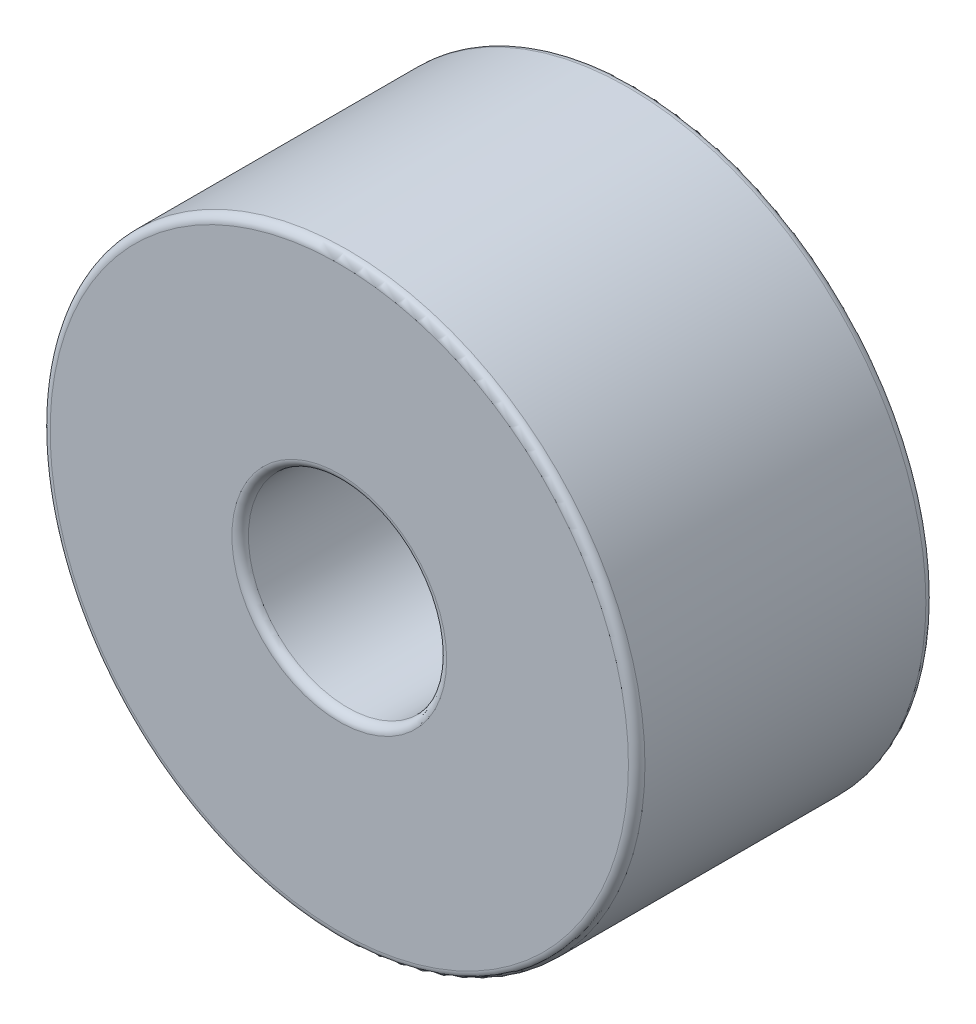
ISO-10303-21;
HEADER;
FILE_DESCRIPTION(('STEP AP214'),'2;1');
FILE_NAME('part.step','',(''),(''),'','','');
FILE_SCHEMA(('AUTOMOTIVE_DESIGN { 1 0 10303 214 1 1 1 1 }'));
ENDSEC;
DATA;
#1=APPLICATION_CONTEXT('core data for automotive mechanical design processes');
#2=APPLICATION_PROTOCOL_DEFINITION('international standard','automotive_design',2000,#1);
#3=PRODUCT_CONTEXT('',#1,'mechanical');
#4=PRODUCT('Part','Part','',(#3));
#5=PRODUCT_RELATED_PRODUCT_CATEGORY('part','',(#4));
#6=PRODUCT_DEFINITION_FORMATION('','',#4);
#7=PRODUCT_DEFINITION_CONTEXT('part definition',#1,'design');
#8=PRODUCT_DEFINITION('design','',#6,#7);
#9=PRODUCT_DEFINITION_SHAPE('','',#8);
#10=(LENGTH_UNIT() NAMED_UNIT(*) SI_UNIT(.MILLI.,.METRE.));
#11=(NAMED_UNIT(*) PLANE_ANGLE_UNIT() SI_UNIT($,.RADIAN.));
#12=(NAMED_UNIT(*) SI_UNIT($,.STERADIAN.) SOLID_ANGLE_UNIT());
#13=UNCERTAINTY_MEASURE_WITH_UNIT(LENGTH_MEASURE(1.E-05),#10,'distance_accuracy_value','');
#14=(GEOMETRIC_REPRESENTATION_CONTEXT(3) GLOBAL_UNCERTAINTY_ASSIGNED_CONTEXT((#13)) GLOBAL_UNIT_ASSIGNED_CONTEXT((#10,
#11,#12)) REPRESENTATION_CONTEXT('',''));
#15=CARTESIAN_POINT('',(0.,0.,0.));
#16=DIRECTION('',(0.,0.,1.));
#17=DIRECTION('',(1.,0.,0.));
#18=AXIS2_PLACEMENT_3D('',#15,#16,#17);
#19=CARTESIAN_POINT('',(0.,0.,18.));
#20=DIRECTION('',(0.,0.,1.));
#21=DIRECTION('',(1.,0.,0.));
#22=AXIS2_PLACEMENT_3D('',#19,#20,#21);
#23=PLANE('',#22);
#24=CARTESIAN_POINT('',(0.,0.,18.));
#25=DIRECTION('',(0.,0.,1.));
#26=DIRECTION('',(1.,0.,0.));
#27=AXIS2_PLACEMENT_3D('',#24,#25,#26);
#28=CIRCLE('',#27,6.5);
#29=CARTESIAN_POINT('',(6.5,0.,18.));
#30=VERTEX_POINT('',#29);
#31=EDGE_CURVE('E10',#30,#30,#28,.F.);
#32=ORIENTED_EDGE('',*,*,#31,.T.);
#33=EDGE_LOOP('',(#32));
#34=FACE_BOUND('',#33,.T.);
#35=CARTESIAN_POINT('',(0.,0.,18.));
#36=DIRECTION('',(0.,0.,1.));
#37=DIRECTION('',(1.,0.,0.));
#38=AXIS2_PLACEMENT_3D('',#35,#36,#37);
#39=CIRCLE('',#38,17.5);
#40=CARTESIAN_POINT('',(17.5,0.,18.));
#41=VERTEX_POINT('',#40);
#42=EDGE_CURVE('E32',#41,#41,#39,.T.);
#43=ORIENTED_EDGE('',*,*,#42,.T.);
#44=EDGE_LOOP('',(#43));
#45=FACE_BOUND('',#44,.T.);
#46=ADVANCED_FACE('F25',(#34,#45),#23,.T.);
#47=CARTESIAN_POINT('',(0.,0.,0.));
#48=DIRECTION('',(0.,0.,1.));
#49=DIRECTION('',(1.,0.,0.));
#50=AXIS2_PLACEMENT_3D('',#47,#48,#49);
#51=PLANE('',#50);
#52=CARTESIAN_POINT('',(0.,0.,0.));
#53=DIRECTION('',(0.,0.,1.));
#54=DIRECTION('',(1.,0.,0.));
#55=AXIS2_PLACEMENT_3D('',#52,#53,#54);
#56=CIRCLE('',#55,6.5);
#57=CARTESIAN_POINT('',(6.5,0.,0.));
#58=VERTEX_POINT('',#57);
#59=EDGE_CURVE('E51',#58,#58,#56,.T.);
#60=ORIENTED_EDGE('',*,*,#59,.T.);
#61=EDGE_LOOP('',(#60));
#62=FACE_BOUND('',#61,.T.);
#63=CARTESIAN_POINT('',(0.,0.,0.));
#64=DIRECTION('',(0.,0.,1.));
#65=DIRECTION('',(1.,0.,0.));
#66=AXIS2_PLACEMENT_3D('',#63,#64,#65);
#67=CIRCLE('',#66,17.5);
#68=CARTESIAN_POINT('',(17.5,0.,0.));
#69=VERTEX_POINT('',#68);
#70=EDGE_CURVE('E54',#69,#69,#67,.F.);
#71=ORIENTED_EDGE('',*,*,#70,.T.);
#72=EDGE_LOOP('',(#71));
#73=FACE_BOUND('',#72,.T.);
#74=ADVANCED_FACE('F58',(#62,#73),#51,.F.);
#75=CARTESIAN_POINT('',(0.,0.,18.));
#76=DIRECTION('',(0.,0.,-1.));
#77=DIRECTION('',(-1.,0.,0.));
#78=AXIS2_PLACEMENT_3D('',#75,#76,#77);
#79=CYLINDRICAL_SURFACE('',#78,18.);
#80=CARTESIAN_POINT('',(0.,0.,0.5));
#81=DIRECTION('',(0.,0.,1.));
#82=DIRECTION('',(1.,0.,0.));
#83=AXIS2_PLACEMENT_3D('',#80,#81,#82);
#84=CIRCLE('',#83,18.);
#85=CARTESIAN_POINT('',(18.,0.,0.5));
#86=VERTEX_POINT('',#85);
#87=EDGE_CURVE('E36',#86,#86,#84,.T.);
#88=ORIENTED_EDGE('',*,*,#87,.T.);
#89=EDGE_LOOP('',(#88));
#90=FACE_BOUND('',#89,.T.);
#91=CARTESIAN_POINT('',(0.,0.,17.5));
#92=DIRECTION('',(0.,0.,1.));
#93=DIRECTION('',(1.,0.,0.));
#94=AXIS2_PLACEMENT_3D('',#91,#92,#93);
#95=CIRCLE('',#94,18.);
#96=CARTESIAN_POINT('',(18.,0.,17.5));
#97=VERTEX_POINT('',#96);
#98=EDGE_CURVE('E40',#97,#97,#95,.F.);
#99=ORIENTED_EDGE('',*,*,#98,.T.);
#100=EDGE_LOOP('',(#99));
#101=FACE_BOUND('',#100,.T.);
#102=ADVANCED_FACE('F27',(#90,#101),#79,.T.);
#103=CARTESIAN_POINT('',(0.,0.,18.));
#104=DIRECTION('',(0.,0.,-1.));
#105=DIRECTION('',(-1.,0.,0.));
#106=AXIS2_PLACEMENT_3D('',#103,#104,#105);
#107=CYLINDRICAL_SURFACE('',#106,6.);
#108=CARTESIAN_POINT('',(0.,0.,0.5));
#109=DIRECTION('',(0.,0.,1.));
#110=DIRECTION('',(1.,0.,0.));
#111=AXIS2_PLACEMENT_3D('',#108,#109,#110);
#112=CIRCLE('',#111,6.);
#113=CARTESIAN_POINT('',(6.,0.,0.5));
#114=VERTEX_POINT('',#113);
#115=EDGE_CURVE('E45',#114,#114,#112,.F.);
#116=ORIENTED_EDGE('',*,*,#115,.T.);
#117=EDGE_LOOP('',(#116));
#118=FACE_BOUND('',#117,.T.);
#119=CARTESIAN_POINT('',(0.,0.,17.5));
#120=DIRECTION('',(0.,0.,1.));
#121=DIRECTION('',(1.,0.,0.));
#122=AXIS2_PLACEMENT_3D('',#119,#120,#121);
#123=CIRCLE('',#122,6.);
#124=CARTESIAN_POINT('',(6.,0.,17.5));
#125=VERTEX_POINT('',#124);
#126=EDGE_CURVE('E48',#125,#125,#123,.T.);
#127=ORIENTED_EDGE('',*,*,#126,.T.);
#128=EDGE_LOOP('',(#127));
#129=FACE_BOUND('',#128,.T.);
#130=ADVANCED_FACE('F70',(#118,#129),#107,.F.);
#131=CARTESIAN_POINT('',(0.,0.,0.5));
#132=DIRECTION('',(0.,0.,1.));
#133=DIRECTION('',(1.,0.,0.));
#134=AXIS2_PLACEMENT_3D('',#131,#132,#133);
#135=TOROIDAL_SURFACE('',#134,6.5,0.5);
#136=ORIENTED_EDGE('',*,*,#115,.F.);
#137=EDGE_LOOP('',(#136));
#138=FACE_BOUND('',#137,.T.);
#139=ORIENTED_EDGE('',*,*,#59,.F.);
#140=EDGE_LOOP('',(#139));
#141=FACE_BOUND('',#140,.T.);
#142=ADVANCED_FACE('F64',(#138,#141),#135,.T.);
#143=CARTESIAN_POINT('',(0.,0.,0.5));
#144=DIRECTION('',(0.,0.,1.));
#145=DIRECTION('',(1.,0.,0.));
#146=AXIS2_PLACEMENT_3D('',#143,#144,#145);
#147=TOROIDAL_SURFACE('',#146,17.5,0.5);
#148=ORIENTED_EDGE('',*,*,#70,.F.);
#149=EDGE_LOOP('',(#148));
#150=FACE_BOUND('',#149,.T.);
#151=ORIENTED_EDGE('',*,*,#87,.F.);
#152=EDGE_LOOP('',(#151));
#153=FACE_BOUND('',#152,.T.);
#154=ADVANCED_FACE('F60',(#150,#153),#147,.T.);
#155=CARTESIAN_POINT('',(0.,0.,17.5));
#156=DIRECTION('',(0.,0.,1.));
#157=DIRECTION('',(1.,0.,0.));
#158=AXIS2_PLACEMENT_3D('',#155,#156,#157);
#159=TOROIDAL_SURFACE('',#158,6.5,0.5);
#160=ORIENTED_EDGE('',*,*,#31,.F.);
#161=EDGE_LOOP('',(#160));
#162=FACE_BOUND('',#161,.T.);
#163=ORIENTED_EDGE('',*,*,#126,.F.);
#164=EDGE_LOOP('',(#163));
#165=FACE_BOUND('',#164,.T.);
#166=ADVANCED_FACE('F63',(#162,#165),#159,.T.);
#167=CARTESIAN_POINT('',(0.,0.,17.5));
#168=DIRECTION('',(0.,0.,1.));
#169=DIRECTION('',(1.,0.,0.));
#170=AXIS2_PLACEMENT_3D('',#167,#168,#169);
#171=TOROIDAL_SURFACE('',#170,17.5,0.5);
#172=ORIENTED_EDGE('',*,*,#98,.F.);
#173=EDGE_LOOP('',(#172));
#174=FACE_BOUND('',#173,.T.);
#175=ORIENTED_EDGE('',*,*,#42,.F.);
#176=EDGE_LOOP('',(#175));
#177=FACE_BOUND('',#176,.T.);
#178=ADVANCED_FACE('F73',(#174,#177),#171,.T.);
#179=CLOSED_SHELL('',(#46,#74,#102,#130,#142,#154,#166,#178));
#180=MANIFOLD_SOLID_BREP('B2',#179);
#181=ADVANCED_BREP_SHAPE_REPRESENTATION('',(#18,#180),#14);
#182=SHAPE_DEFINITION_REPRESENTATION(#9,#181);
ENDSEC;
END-ISO-10303-21;
